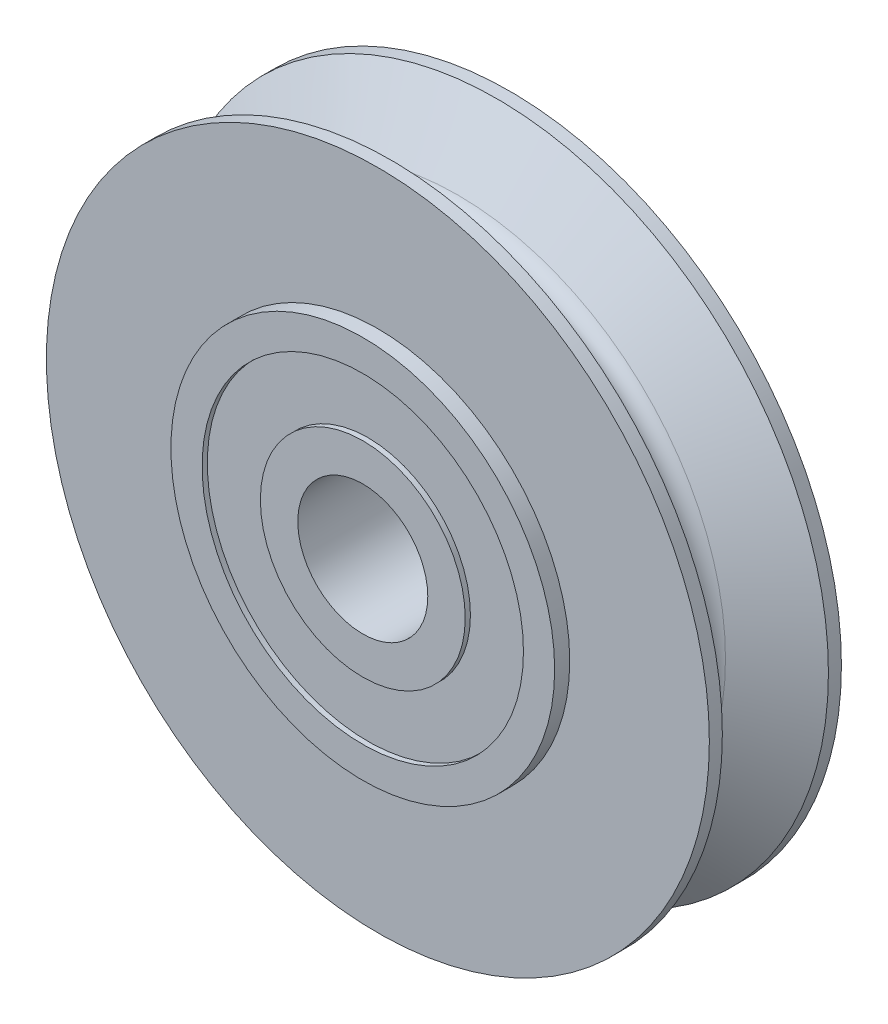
from build123d import *

# Parameters (mm, degrees)
SKETCH1_R         = 0.0555625
CIRPATTERN1_COUNT = 20


with BuildPart() as part:
    # Sketch1 → Revolve1 (revolve)
    with BuildSketch(Plane(origin=(0, 0, 0), x_dir=(0, 0, -1), z_dir=(1, 0, 0)), mode=Mode.PRIVATE) as revolve1_sk:
        with BuildLine():
            Line((1.2954, 8.09625), (1.6129, 8.09625))
            Line((1.6129, 8.09625), (1.6129, 4.6863))
            Line((1.6129, 4.6863), (1.9812, 4.6863))
            Line((1.9812, 4.6863), (1.9812, 3.9243))
            Line((1.9812, 3.9243), (1.8542, 3.9243))
            Line((1.8542, 3.9243), (1.8542, 2.5019))
            Line((1.8542, 2.5019), (1.9812, 2.5019))
            Line((1.9812, 2.5019), (1.9812, 1.5875))
            Line((1.9812, 1.5875), (-1.9812, 1.5875))
            Line((-1.9812, 1.5875), (-1.9812, 2.5019))
            Line((-1.9812, 2.5019), (-1.8542, 2.5019))
            Line((-1.8542, 2.5019), (-1.8542, 3.9243))
            Line((-1.8542, 3.9243), (-1.9812, 3.9243))
            Line((-1.9812, 3.9243), (-1.9812, 4.6863))
            Line((-1.9812, 4.6863), (-1.6129, 4.6863))
            Line((-1.6129, 4.6863), (-1.6129, 8.09625))
            Line((-1.6129, 8.09625), (-1.2954, 8.09625))
            Line((-1.2954, 8.09625), (-0.338097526, 6.539029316))
            ThreePointArc((-0.338097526, 6.539029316), (0, 6.35), (0.338097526, 6.539029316))
            Line((0.338097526, 6.539029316), (1.2954, 8.09625))
        make_face()
        with Locations((0, 2.38125)):
            Circle(SKETCH1_R, mode=Mode.SUBTRACT)
    revolve(revolve1_sk.sketch.rotate(Axis((0, 0, 1.5875), (0, 0, -1)), 90), axis=Axis((0, 0, 1.5875), (0, 0, -1)))


with BuildPart() as body_2:
    # Sketch3 → Revolve2 (revolve)
    with BuildSketch(Plane(origin=(0, 0, 0), x_dir=(0, 0, -1), z_dir=(1, 0, 0))):
        with BuildLine():
            Line((0, 2.4368125), (0, 2.3256875))
            ThreePointArc((0, 2.3256875), (0.0555625, 2.38125), (0, 2.4368125))
        make_face()
    revolve(axis=Axis((0, 2.4368125, 0), (0, -1, 0)))


with BuildPart() as cirpattern1_1:
    # CirPattern1: pattern copy
    add(body_2.part.rotate(Axis((0, 0, 0), (0, 0, 1)), 1 * 360 / CIRPATTERN1_COUNT))


with BuildPart() as cirpattern1_2:
    # CirPattern1: pattern copy
    add(body_2.part.rotate(Axis((0, 0, 0), (0, 0, 1)), 2 * 360 / CIRPATTERN1_COUNT))


with BuildPart() as cirpattern1_3:
    # CirPattern1: pattern copy
    add(body_2.part.rotate(Axis((0, 0, 0), (0, 0, 1)), 3 * 360 / CIRPATTERN1_COUNT))


with BuildPart() as cirpattern1_4:
    # CirPattern1: pattern copy
    add(body_2.part.rotate(Axis((0, 0, 0), (0, 0, 1)), 4 * 360 / CIRPATTERN1_COUNT))


with BuildPart() as cirpattern1_5:
    # CirPattern1: pattern copy
    add(body_2.part.rotate(Axis((0, 0, 0), (0, 0, 1)), 5 * 360 / CIRPATTERN1_COUNT))


with BuildPart() as cirpattern1_6:
    # CirPattern1: pattern copy
    add(body_2.part.rotate(Axis((0, 0, 0), (0, 0, 1)), 6 * 360 / CIRPATTERN1_COUNT))


with BuildPart() as cirpattern1_7:
    # CirPattern1: pattern copy
    add(body_2.part.rotate(Axis((0, 0, 0), (0, 0, 1)), 7 * 360 / CIRPATTERN1_COUNT))


with BuildPart() as cirpattern1_8:
    # CirPattern1: pattern copy
    add(body_2.part.rotate(Axis((0, 0, 0), (0, 0, 1)), 8 * 360 / CIRPATTERN1_COUNT))


with BuildPart() as cirpattern1_9:
    # CirPattern1: pattern copy
    add(body_2.part.rotate(Axis((0, 0, 0), (0, 0, 1)), 9 * 360 / CIRPATTERN1_COUNT))


with BuildPart() as cirpattern1_10:
    # CirPattern1: pattern copy
    add(body_2.part.rotate(Axis((0, 0, 0), (0, 0, 1)), 10 * 360 / CIRPATTERN1_COUNT))


with BuildPart() as cirpattern1_11:
    # CirPattern1: pattern copy
    add(body_2.part.rotate(Axis((0, 0, 0), (0, 0, 1)), 11 * 360 / CIRPATTERN1_COUNT))


with BuildPart() as cirpattern1_12:
    # CirPattern1: pattern copy
    add(body_2.part.rotate(Axis((0, 0, 0), (0, 0, 1)), 12 * 360 / CIRPATTERN1_COUNT))


with BuildPart() as cirpattern1_13:
    # CirPattern1: pattern copy
    add(body_2.part.rotate(Axis((0, 0, 0), (0, 0, 1)), 13 * 360 / CIRPATTERN1_COUNT))


with BuildPart() as cirpattern1_14:
    # CirPattern1: pattern copy
    add(body_2.part.rotate(Axis((0, 0, 0), (0, 0, 1)), 14 * 360 / CIRPATTERN1_COUNT))


with BuildPart() as cirpattern1_15:
    # CirPattern1: pattern copy
    add(body_2.part.rotate(Axis((0, 0, 0), (0, 0, 1)), 15 * 360 / CIRPATTERN1_COUNT))


with BuildPart() as cirpattern1_16:
    # CirPattern1: pattern copy
    add(body_2.part.rotate(Axis((0, 0, 0), (0, 0, 1)), 16 * 360 / CIRPATTERN1_COUNT))


with BuildPart() as cirpattern1_17:
    # CirPattern1: pattern copy
    add(body_2.part.rotate(Axis((0, 0, 0), (0, 0, 1)), 17 * 360 / CIRPATTERN1_COUNT))


with BuildPart() as cirpattern1_18:
    # CirPattern1: pattern copy
    add(body_2.part.rotate(Axis((0, 0, 0), (0, 0, 1)), 18 * 360 / CIRPATTERN1_COUNT))


with BuildPart() as cirpattern1_19:
    # CirPattern1: pattern copy
    add(body_2.part.rotate(Axis((0, 0, 0), (0, 0, 1)), 19 * 360 / CIRPATTERN1_COUNT))


solid = Compound([part.part, body_2.part, cirpattern1_1.part, cirpattern1_2.part, cirpattern1_3.part, cirpattern1_4.part, cirpattern1_5.part, cirpattern1_6.part, cirpattern1_7.part, cirpattern1_8.part, cirpattern1_9.part, cirpattern1_10.part, cirpattern1_11.part, cirpattern1_12.part, cirpattern1_13.part, cirpattern1_14.part, cirpattern1_15.part, cirpattern1_16.part, cirpattern1_17.part, cirpattern1_18.part, cirpattern1_19.part])
